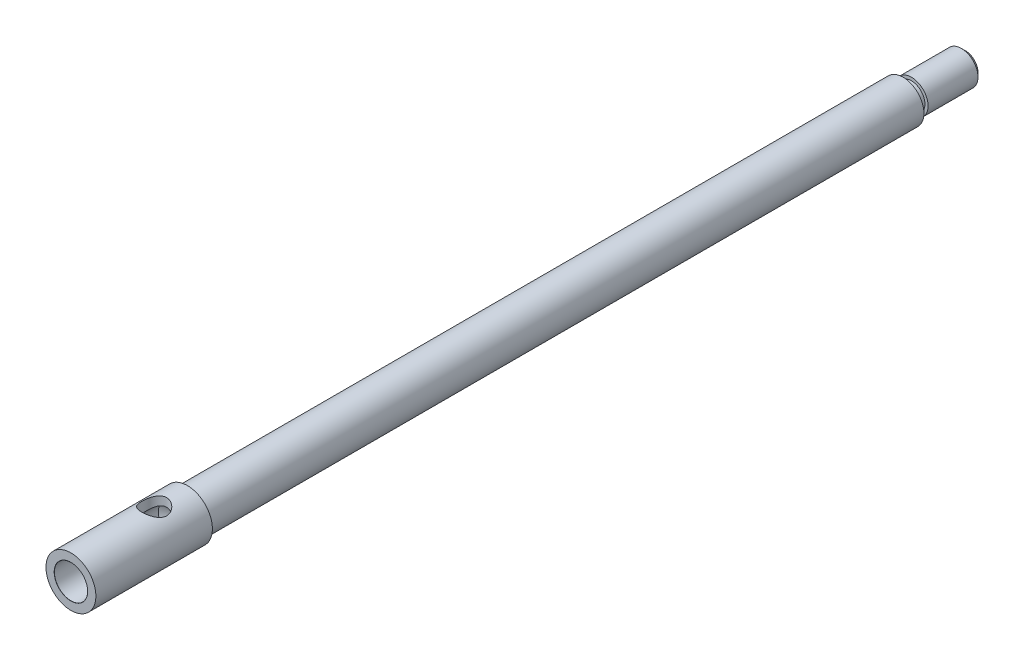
from build123d import *

# Parameters (mm, degrees)
SKETCH_1_R            = 4
EXTRUDE_1_DEPTH       = 13
SKETCH_2_R            = 3.25
EXTRUDE_2_DEPTH       = 2
SKETCH_3_R            = 5
EXTRUDE_4_DEPTH       = 172
SKETCH_4_R            = 6
EXTRUDE_5_DEPTH       = 28
CHAMFER_1_SIZE        = 1
F_8_0MM_2_D           = 8
F_8_0MM_2_DEPTH       = 25
F_8_0MM_2_CSINK_D     = 8.05
F_8_0MM_2_CSINK_ANGLE = 90
F_8_0MM_2_TIP         = 2.403442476


with BuildPart() as part:
    # Sketch 1 → Extrude 1 (new body)
    with BuildSketch(Plane.XY):
        with Locations(Location((0, 0, 0), (0, 0, 180))):
            Circle(SKETCH_1_R)
    extrude(amount=EXTRUDE_1_DEPTH)

    # Sketch 2 → Extrude 2 (add)
    with BuildSketch(Plane.XY.offset(13)):
        Circle(SKETCH_2_R)
    extrude(amount=EXTRUDE_2_DEPTH)

    # Sketch 3 → Extrude 4 (add)
    with BuildSketch(Plane.XY.offset(15)):
        Circle(SKETCH_3_R)
    extrude(amount=EXTRUDE_4_DEPTH)

    # Sketch 4 → Extrude 5 (add)
    with BuildSketch(Plane.XY.offset(187)):
        Circle(SKETCH_4_R)
    extrude(amount=EXTRUDE_5_DEPTH)

    # Chamfer 1
    chamfer_1_edges = [part.edges().sort_by_distance(p)[0] for p in [
        (4, 0, 0),
    ]]
    chamfer(chamfer_1_edges, length=CHAMFER_1_SIZE)

    # 8.0mm _2
    with Locations(Plane.XY.offset(215)):
        with Locations((0, 0)):
            CounterSinkHole(F_8_0MM_2_D / 2, F_8_0MM_2_CSINK_D / 2, depth=F_8_0MM_2_DEPTH, counter_sink_angle=F_8_0MM_2_CSINK_ANGLE)
            with Locations((0, 0, -(F_8_0MM_2_DEPTH + F_8_0MM_2_TIP / 2))):  # 118° drill point
                Cone(0, F_8_0MM_2_D / 2, F_8_0MM_2_TIP, mode=Mode.SUBTRACT)

    # Sketch 15 → 6.0mm _2 (revolve, cut)
    with BuildSketch(Plane(origin=(0, 0, 195), x_dir=(0, 0, -1), z_dir=(1, 0, 0))):
        Polygon((0, 0), (0, 6), (3, 6), (3, 0.025), (3.025, 0), align=None)
    f_6_0mm_2 = revolve(axis=Axis((0, -6.35, 195), (0, 1, 0)), mode=Mode.SUBTRACT)

    # Mirror 1: 6.0mm _2 across plane
    add(f_6_0mm_2.mirror(Plane.ZX), mode=Mode.SUBTRACT)


solid = part.part
